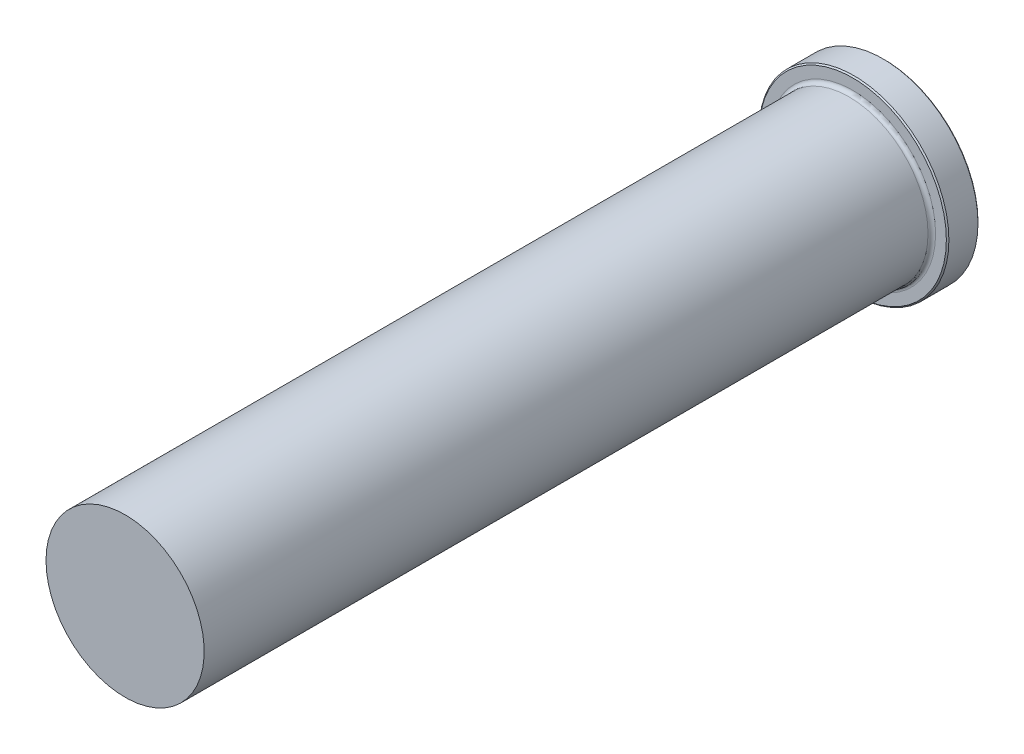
from build123d import *

# Parameters (mm, degrees)
FILLET1_R     = 0.762
CHAMFER1_SIZE = 0.254


with BuildPart() as part:
    # Sketch1 → Revolve1 (revolve)
    with BuildSketch(Plane(origin=(0, 0, 0), x_dir=(0, 0, -1), z_dir=(1, 0, 0)), mode=Mode.PRIVATE) as revolve1_sk:
        Polygon((0, 0), (0, 19.05), (-6.35, 19.05), (-6.35, 15.875), (-152.4, 15.875), (-152.4, 0), align=None)
    revolve(revolve1_sk.sketch.rotate(Axis((0, 0, 0), (0, 0, 1)), 90), axis=Axis((0, 0, 0), (0, 0, 1)))

    # Fillet1
    fillet1_edges = [part.edges().sort_by_distance(p)[0] for p in [
        (15.875, 0, 6.35),
    ]]
    fillet(fillet1_edges, radius=FILLET1_R)

    # Chamfer1
    chamfer1_edges = [part.edges().sort_by_distance(p)[0] for p in [
        (19.05, 0, 6.35),
        (19.05, 0, 0),
    ]]
    chamfer(chamfer1_edges, length=CHAMFER1_SIZE)


solid = part.part
